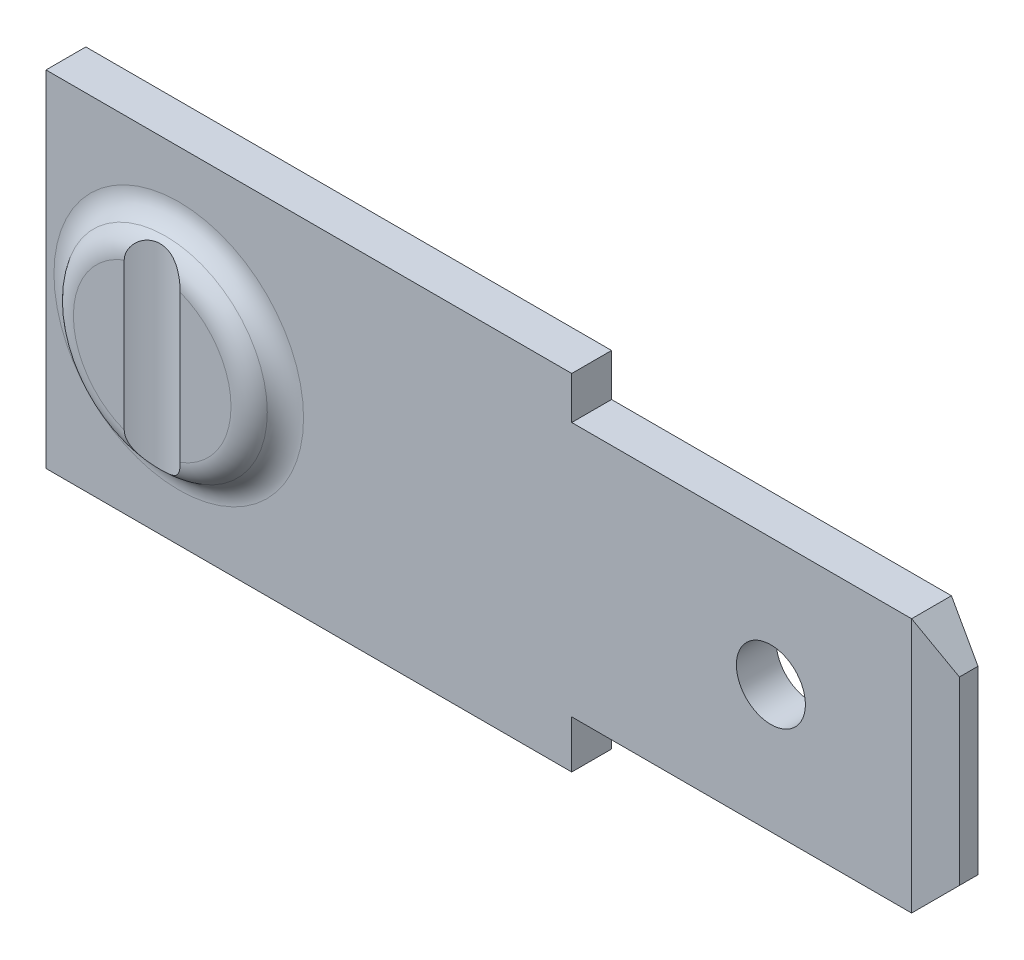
ISO-10303-21;
HEADER;
FILE_DESCRIPTION(('STEP AP214'),'2;1');
FILE_NAME('part.step','',(''),(''),'','','');
FILE_SCHEMA(('AUTOMOTIVE_DESIGN { 1 0 10303 214 1 1 1 1 }'));
ENDSEC;
DATA;
#1=APPLICATION_CONTEXT('core data for automotive mechanical design processes');
#2=APPLICATION_PROTOCOL_DEFINITION('international standard','automotive_design',2000,#1);
#3=PRODUCT_CONTEXT('',#1,'mechanical');
#4=PRODUCT('Part','Part','',(#3));
#5=PRODUCT_RELATED_PRODUCT_CATEGORY('part','',(#4));
#6=PRODUCT_DEFINITION_FORMATION('','',#4);
#7=PRODUCT_DEFINITION_CONTEXT('part definition',#1,'design');
#8=PRODUCT_DEFINITION('design','',#6,#7);
#9=PRODUCT_DEFINITION_SHAPE('','',#8);
#10=(LENGTH_UNIT() NAMED_UNIT(*) SI_UNIT(.MILLI.,.METRE.));
#11=(NAMED_UNIT(*) PLANE_ANGLE_UNIT() SI_UNIT($,.RADIAN.));
#12=(NAMED_UNIT(*) SI_UNIT($,.STERADIAN.) SOLID_ANGLE_UNIT());
#13=UNCERTAINTY_MEASURE_WITH_UNIT(LENGTH_MEASURE(1.E-05),#10,'distance_accuracy_value','');
#14=(GEOMETRIC_REPRESENTATION_CONTEXT(3) GLOBAL_UNCERTAINTY_ASSIGNED_CONTEXT((#13)) GLOBAL_UNIT_ASSIGNED_CONTEXT((#10,
#11,#12)) REPRESENTATION_CONTEXT('',''));
#15=CARTESIAN_POINT('',(0.,0.,0.));
#16=DIRECTION('',(0.,0.,1.));
#17=DIRECTION('',(1.,0.,0.));
#18=AXIS2_PLACEMENT_3D('',#15,#16,#17);
#19=CARTESIAN_POINT('',(2.5,3.25,1.25));
#20=DIRECTION('',(0.,0.,1.));
#21=DIRECTION('',(1.,0.,0.));
#22=AXIS2_PLACEMENT_3D('',#19,#20,#21);
#23=PLANE('',#22);
#24=DIRECTION('',(0.,-1.,0.));
#25=VECTOR('',#24,1.);
#26=CARTESIAN_POINT('',(1.97321731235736,6.5,1.25));
#27=LINE('',#26,#25);
#28=CARTESIAN_POINT('',(1.97321731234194,4.63732858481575,1.2500000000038));
#29=VERTEX_POINT('',#28);
#30=CARTESIAN_POINT('',(1.97321731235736,1.86267141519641,1.25));
#31=VERTEX_POINT('',#30);
#32=EDGE_CURVE('E124',#29,#31,#27,.T.);
#33=ORIENTED_EDGE('',*,*,#32,.F.);
#34=CARTESIAN_POINT('',(2.5,3.25,1.25));
#35=DIRECTION('',(0.,0.,1.));
#36=DIRECTION('',(1.,0.,0.));
#37=AXIS2_PLACEMENT_3D('',#34,#35,#36);
#38=CIRCLE('',#37,1.48397459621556);
#39=EDGE_CURVE('E133',#29,#31,#38,.T.);
#40=ORIENTED_EDGE('',*,*,#39,.T.);
#41=EDGE_LOOP('',(#33,#40));
#42=FACE_BOUND('',#41,.T.);
#43=ADVANCED_FACE('F31',(#42),#23,.T.);
#44=CARTESIAN_POINT('',(0.,6.5,0.75));
#45=DIRECTION('',(0.,0.,-1.));
#46=DIRECTION('',(-1.,0.,0.));
#47=AXIS2_PLACEMENT_3D('',#44,#45,#46);
#48=PLANE('',#47);
#49=CARTESIAN_POINT('',(2.5,3.25,0.75));
#50=DIRECTION('',(0.,0.,-1.));
#51=DIRECTION('',(-1.,0.,0.));
#52=AXIS2_PLACEMENT_3D('',#49,#50,#51);
#53=CIRCLE('',#52,2.35);
#54=CARTESIAN_POINT('',(0.15,3.25,0.75));
#55=VERTEX_POINT('',#54);
#56=EDGE_CURVE('E141',#55,#55,#53,.T.);
#57=ORIENTED_EDGE('',*,*,#56,.T.);
#58=EDGE_LOOP('',(#57));
#59=FACE_BOUND('',#58,.T.);
#60=CARTESIAN_POINT('',(13.65,3.3,0.75));
#61=DIRECTION('',(0.,0.,1.));
#62=DIRECTION('',(1.,0.,0.));
#63=AXIS2_PLACEMENT_3D('',#60,#61,#62);
#64=CIRCLE('',#63,0.649999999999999);
#65=CARTESIAN_POINT('',(14.3,3.3,0.75));
#66=VERTEX_POINT('',#65);
#67=EDGE_CURVE('E404',#66,#66,#64,.T.);
#68=ORIENTED_EDGE('',*,*,#67,.F.);
#69=EDGE_LOOP('',(#68));
#70=FACE_BOUND('',#69,.T.);
#71=DIRECTION('',(1.,0.,0.));
#72=VECTOR('',#71,1.);
#73=CARTESIAN_POINT('',(9.9,0.9,0.75));
#74=LINE('',#73,#72);
#75=CARTESIAN_POINT('',(9.9,0.9,0.75));
#76=VERTEX_POINT('',#75);
#77=CARTESIAN_POINT('',(16.3,0.9,0.75));
#78=VERTEX_POINT('',#77);
#79=EDGE_CURVE('E410',#76,#78,#74,.T.);
#80=ORIENTED_EDGE('',*,*,#79,.T.);
#81=DIRECTION('',(0.,1.,0.));
#82=VECTOR('',#81,1.);
#83=CARTESIAN_POINT('',(16.3,6.5,0.75));
#84=LINE('',#83,#82);
#85=CARTESIAN_POINT('',(16.3,5.7,0.75));
#86=VERTEX_POINT('',#85);
#87=EDGE_CURVE('E355',#78,#86,#84,.T.);
#88=ORIENTED_EDGE('',*,*,#87,.T.);
#89=DIRECTION('',(-1.,0.,0.));
#90=VECTOR('',#89,1.);
#91=CARTESIAN_POINT('',(9.9,5.7,0.75));
#92=LINE('',#91,#90);
#93=CARTESIAN_POINT('',(9.9,5.7,0.75));
#94=VERTEX_POINT('',#93);
#95=EDGE_CURVE('E408',#86,#94,#92,.T.);
#96=ORIENTED_EDGE('',*,*,#95,.T.);
#97=DIRECTION('',(0.,1.,0.));
#98=VECTOR('',#97,1.);
#99=CARTESIAN_POINT('',(9.9,5.7,0.75));
#100=LINE('',#99,#98);
#101=CARTESIAN_POINT('',(9.9,6.5,0.75));
#102=VERTEX_POINT('',#101);
#103=EDGE_CURVE('E406',#94,#102,#100,.T.);
#104=ORIENTED_EDGE('',*,*,#103,.T.);
#105=DIRECTION('',(-1.,0.,0.));
#106=VECTOR('',#105,1.);
#107=CARTESIAN_POINT('',(0.,6.5,0.75));
#108=LINE('',#107,#106);
#109=CARTESIAN_POINT('',(0.,6.5,0.75));
#110=VERTEX_POINT('',#109);
#111=EDGE_CURVE('E386',#102,#110,#108,.T.);
#112=ORIENTED_EDGE('',*,*,#111,.T.);
#113=DIRECTION('',(0.,-1.,0.));
#114=VECTOR('',#113,1.);
#115=CARTESIAN_POINT('',(0.,0.,0.75));
#116=LINE('',#115,#114);
#117=CARTESIAN_POINT('',(0.,0.,0.75));
#118=VERTEX_POINT('',#117);
#119=EDGE_CURVE('E389',#110,#118,#116,.T.);
#120=ORIENTED_EDGE('',*,*,#119,.T.);
#121=DIRECTION('',(1.,0.,0.));
#122=VECTOR('',#121,1.);
#123=CARTESIAN_POINT('',(0.,0.,0.75));
#124=LINE('',#123,#122);
#125=CARTESIAN_POINT('',(9.9,0.,0.75));
#126=VERTEX_POINT('',#125);
#127=EDGE_CURVE('E415',#118,#126,#124,.T.);
#128=ORIENTED_EDGE('',*,*,#127,.T.);
#129=DIRECTION('',(0.,1.,0.));
#130=VECTOR('',#129,1.);
#131=CARTESIAN_POINT('',(9.9,0.,0.75));
#132=LINE('',#131,#130);
#133=EDGE_CURVE('E413',#126,#76,#132,.T.);
#134=ORIENTED_EDGE('',*,*,#133,.T.);
#135=EDGE_LOOP('',(#80,#88,#96,#104,#112,#120,#128,#134));
#136=FACE_BOUND('',#135,.T.);
#137=ADVANCED_FACE('F162',(#59,#70,#136),#48,.F.);
#138=CARTESIAN_POINT('',(0.,6.5,0.));
#139=DIRECTION('',(0.,0.,-1.));
#140=DIRECTION('',(-1.,0.,0.));
#141=AXIS2_PLACEMENT_3D('',#138,#139,#140);
#142=PLANE('',#141);
#143=DIRECTION('',(-1.,0.,0.));
#144=VECTOR('',#143,1.);
#145=CARTESIAN_POINT('',(9.9,5.7,0.));
#146=LINE('',#145,#144);
#147=CARTESIAN_POINT('',(16.3,5.7,0.));
#148=VERTEX_POINT('',#147);
#149=CARTESIAN_POINT('',(9.9,5.7,0.));
#150=VERTEX_POINT('',#149);
#151=EDGE_CURVE('E392',#148,#150,#146,.T.);
#152=ORIENTED_EDGE('',*,*,#151,.F.);
#153=DIRECTION('',(0.,-1.,0.));
#154=VECTOR('',#153,1.);
#155=CARTESIAN_POINT('',(16.3,1.6,0.));
#156=LINE('',#155,#154);
#157=CARTESIAN_POINT('',(16.3,0.9,0.));
#158=VERTEX_POINT('',#157);
#159=EDGE_CURVE('E341',#148,#158,#156,.T.);
#160=ORIENTED_EDGE('',*,*,#159,.T.);
#161=DIRECTION('',(1.,0.,0.));
#162=VECTOR('',#161,1.);
#163=CARTESIAN_POINT('',(9.9,0.9,0.));
#164=LINE('',#163,#162);
#165=CARTESIAN_POINT('',(9.9,0.9,0.));
#166=VERTEX_POINT('',#165);
#167=EDGE_CURVE('E394',#166,#158,#164,.T.);
#168=ORIENTED_EDGE('',*,*,#167,.F.);
#169=DIRECTION('',(0.,1.,0.));
#170=VECTOR('',#169,1.);
#171=CARTESIAN_POINT('',(9.9,0.,0.));
#172=LINE('',#171,#170);
#173=CARTESIAN_POINT('',(9.9,0.,0.));
#174=VERTEX_POINT('',#173);
#175=EDGE_CURVE('E397',#174,#166,#172,.T.);
#176=ORIENTED_EDGE('',*,*,#175,.F.);
#177=DIRECTION('',(1.,0.,0.));
#178=VECTOR('',#177,1.);
#179=CARTESIAN_POINT('',(0.,0.,0.));
#180=LINE('',#179,#178);
#181=CARTESIAN_POINT('',(0.,0.,0.));
#182=VERTEX_POINT('',#181);
#183=EDGE_CURVE('E399',#182,#174,#180,.T.);
#184=ORIENTED_EDGE('',*,*,#183,.F.);
#185=DIRECTION('',(0.,-1.,0.));
#186=VECTOR('',#185,1.);
#187=CARTESIAN_POINT('',(0.,0.,0.));
#188=LINE('',#187,#186);
#189=CARTESIAN_POINT('',(0.,6.5,0.));
#190=VERTEX_POINT('',#189);
#191=EDGE_CURVE('E401',#190,#182,#188,.T.);
#192=ORIENTED_EDGE('',*,*,#191,.F.);
#193=DIRECTION('',(-1.,0.,0.));
#194=VECTOR('',#193,1.);
#195=CARTESIAN_POINT('',(0.,6.5,0.));
#196=LINE('',#195,#194);
#197=CARTESIAN_POINT('',(9.9,6.5,0.));
#198=VERTEX_POINT('',#197);
#199=EDGE_CURVE('E387',#198,#190,#196,.T.);
#200=ORIENTED_EDGE('',*,*,#199,.F.);
#201=DIRECTION('',(0.,1.,0.));
#202=VECTOR('',#201,1.);
#203=CARTESIAN_POINT('',(9.9,5.7,0.));
#204=LINE('',#203,#202);
#205=EDGE_CURVE('E390',#150,#198,#204,.T.);
#206=ORIENTED_EDGE('',*,*,#205,.F.);
#207=EDGE_LOOP('',(#152,#160,#168,#176,#184,#192,#200,#206));
#208=FACE_BOUND('',#207,.T.);
#209=CARTESIAN_POINT('',(13.65,3.3,0.));
#210=DIRECTION('',(0.,0.,1.));
#211=DIRECTION('',(1.,0.,0.));
#212=AXIS2_PLACEMENT_3D('',#209,#210,#211);
#213=CIRCLE('',#212,0.649999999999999);
#214=CARTESIAN_POINT('',(14.3,3.3,0.));
#215=VERTEX_POINT('',#214);
#216=EDGE_CURVE('E134',#215,#215,#213,.T.);
#217=ORIENTED_EDGE('',*,*,#216,.T.);
#218=EDGE_LOOP('',(#217));
#219=FACE_BOUND('',#218,.T.);
#220=ADVANCED_FACE('F165',(#208,#219),#142,.T.);
#221=CARTESIAN_POINT('',(0.,0.,0.75));
#222=DIRECTION('',(1.,0.,0.));
#223=DIRECTION('',(0.,0.,-1.));
#224=AXIS2_PLACEMENT_3D('',#221,#222,#223);
#225=PLANE('',#224);
#226=ORIENTED_EDGE('',*,*,#191,.T.);
#227=DIRECTION('',(0.,0.,-1.));
#228=VECTOR('',#227,1.);
#229=CARTESIAN_POINT('',(0.,0.,0.75));
#230=LINE('',#229,#228);
#231=EDGE_CURVE('E358',#118,#182,#230,.T.);
#232=ORIENTED_EDGE('',*,*,#231,.F.);
#233=ORIENTED_EDGE('',*,*,#119,.F.);
#234=DIRECTION('',(0.,0.,-1.));
#235=VECTOR('',#234,1.);
#236=CARTESIAN_POINT('',(0.,6.5,0.75));
#237=LINE('',#236,#235);
#238=EDGE_CURVE('E383',#110,#190,#237,.T.);
#239=ORIENTED_EDGE('',*,*,#238,.T.);
#240=EDGE_LOOP('',(#226,#232,#233,#239));
#241=FACE_BOUND('',#240,.T.);
#242=ADVANCED_FACE('F169',(#241),#225,.F.);
#243=CARTESIAN_POINT('',(0.,0.,0.75));
#244=DIRECTION('',(0.,1.,0.));
#245=DIRECTION('',(0.,0.,1.));
#246=AXIS2_PLACEMENT_3D('',#243,#244,#245);
#247=PLANE('',#246);
#248=ORIENTED_EDGE('',*,*,#183,.T.);
#249=DIRECTION('',(0.,0.,-1.));
#250=VECTOR('',#249,1.);
#251=CARTESIAN_POINT('',(9.9,0.,0.75));
#252=LINE('',#251,#250);
#253=EDGE_CURVE('E361',#126,#174,#252,.T.);
#254=ORIENTED_EDGE('',*,*,#253,.F.);
#255=ORIENTED_EDGE('',*,*,#127,.F.);
#256=ORIENTED_EDGE('',*,*,#231,.T.);
#257=EDGE_LOOP('',(#248,#254,#255,#256));
#258=FACE_BOUND('',#257,.T.);
#259=ADVANCED_FACE('F200',(#258),#247,.F.);
#260=CARTESIAN_POINT('',(9.9,0.,0.75));
#261=DIRECTION('',(-1.,0.,0.));
#262=DIRECTION('',(0.,0.,1.));
#263=AXIS2_PLACEMENT_3D('',#260,#261,#262);
#264=PLANE('',#263);
#265=ORIENTED_EDGE('',*,*,#175,.T.);
#266=DIRECTION('',(0.,0.,-1.));
#267=VECTOR('',#266,1.);
#268=CARTESIAN_POINT('',(9.9,0.9,0.75));
#269=LINE('',#268,#267);
#270=EDGE_CURVE('E364',#76,#166,#269,.T.);
#271=ORIENTED_EDGE('',*,*,#270,.F.);
#272=ORIENTED_EDGE('',*,*,#133,.F.);
#273=ORIENTED_EDGE('',*,*,#253,.T.);
#274=EDGE_LOOP('',(#265,#271,#272,#273));
#275=FACE_BOUND('',#274,.T.);
#276=ADVANCED_FACE('F196',(#275),#264,.F.);
#277=CARTESIAN_POINT('',(9.9,0.9,0.75));
#278=DIRECTION('',(0.,1.,0.));
#279=DIRECTION('',(-1.,0.,0.));
#280=AXIS2_PLACEMENT_3D('',#277,#278,#279);
#281=PLANE('',#280);
#282=ORIENTED_EDGE('',*,*,#167,.T.);
#283=DIRECTION('',(0.,0.,-1.));
#284=VECTOR('',#283,1.);
#285=CARTESIAN_POINT('',(16.3,0.9,0.75));
#286=LINE('',#285,#284);
#287=EDGE_CURVE('E367',#78,#158,#286,.T.);
#288=ORIENTED_EDGE('',*,*,#287,.F.);
#289=ORIENTED_EDGE('',*,*,#79,.F.);
#290=ORIENTED_EDGE('',*,*,#270,.T.);
#291=EDGE_LOOP('',(#282,#288,#289,#290));
#292=FACE_BOUND('',#291,.T.);
#293=ADVANCED_FACE('F193',(#292),#281,.F.);
#294=CARTESIAN_POINT('',(16.3,0.9,0.75));
#295=DIRECTION('',(-0.707106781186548,0.707106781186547,0.));
#296=DIRECTION('',(-0.707106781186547,-0.707106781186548,0.));
#297=AXIS2_PLACEMENT_3D('',#294,#295,#296);
#298=PLANE('',#297);
#299=ORIENTED_EDGE('',*,*,#287,.T.);
#300=DIRECTION('',(0.693103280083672,0.693103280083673,0.198029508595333));
#301=VECTOR('',#300,1.);
#302=CARTESIAN_POINT('',(18.6333333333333,3.23333333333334,0.666666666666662));
#303=LINE('',#302,#301);
#304=CARTESIAN_POINT('',(17.,1.6,0.2));
#305=VERTEX_POINT('',#304);
#306=EDGE_CURVE('E57',#158,#305,#303,.T.);
#307=ORIENTED_EDGE('',*,*,#306,.T.);
#308=DIRECTION('',(0.,0.,-1.));
#309=VECTOR('',#308,1.);
#310=CARTESIAN_POINT('',(17.,1.6,0.75));
#311=LINE('',#310,#309);
#312=CARTESIAN_POINT('',(17.,1.6,0.549999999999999));
#313=VERTEX_POINT('',#312);
#314=EDGE_CURVE('E369',#313,#305,#311,.T.);
#315=ORIENTED_EDGE('',*,*,#314,.F.);
#316=DIRECTION('',(0.693103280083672,0.693103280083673,-0.198029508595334));
#317=VECTOR('',#316,1.);
#318=CARTESIAN_POINT('',(18.9901960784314,3.59019607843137,-0.0186274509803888));
#319=LINE('',#318,#317);
#320=EDGE_CURVE('E349',#313,#78,#319,.F.);
#321=ORIENTED_EDGE('',*,*,#320,.T.);
#322=EDGE_LOOP('',(#299,#307,#315,#321));
#323=FACE_BOUND('',#322,.T.);
#324=ADVANCED_FACE('F189',(#323),#298,.F.);
#325=CARTESIAN_POINT('',(17.,5.,0.75));
#326=DIRECTION('',(-1.,0.,0.));
#327=DIRECTION('',(0.,0.,1.));
#328=AXIS2_PLACEMENT_3D('',#325,#326,#327);
#329=PLANE('',#328);
#330=ORIENTED_EDGE('',*,*,#314,.T.);
#331=DIRECTION('',(0.,1.,0.));
#332=VECTOR('',#331,1.);
#333=CARTESIAN_POINT('',(17.,5.,0.2));
#334=LINE('',#333,#332);
#335=CARTESIAN_POINT('',(17.,5.,0.2));
#336=VERTEX_POINT('',#335);
#337=EDGE_CURVE('E346',#305,#336,#334,.T.);
#338=ORIENTED_EDGE('',*,*,#337,.T.);
#339=DIRECTION('',(0.,0.,-1.));
#340=VECTOR('',#339,1.);
#341=CARTESIAN_POINT('',(17.,5.,0.75));
#342=LINE('',#341,#340);
#343=CARTESIAN_POINT('',(17.,5.,0.549999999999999));
#344=VERTEX_POINT('',#343);
#345=EDGE_CURVE('E371',#344,#336,#342,.T.);
#346=ORIENTED_EDGE('',*,*,#345,.F.);
#347=DIRECTION('',(0.,-1.,0.));
#348=VECTOR('',#347,1.);
#349=CARTESIAN_POINT('',(17.,5.,0.549999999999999));
#350=LINE('',#349,#348);
#351=EDGE_CURVE('E351',#344,#313,#350,.T.);
#352=ORIENTED_EDGE('',*,*,#351,.T.);
#353=EDGE_LOOP('',(#330,#338,#346,#352));
#354=FACE_BOUND('',#353,.T.);
#355=ADVANCED_FACE('F185',(#354),#329,.F.);
#356=CARTESIAN_POINT('',(16.3,5.7,0.75));
#357=DIRECTION('',(-0.707106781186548,-0.707106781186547,0.));
#358=DIRECTION('',(0.707106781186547,-0.707106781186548,0.));
#359=AXIS2_PLACEMENT_3D('',#356,#357,#358);
#360=PLANE('',#359);
#361=ORIENTED_EDGE('',*,*,#345,.T.);
#362=DIRECTION('',(-0.693103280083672,0.693103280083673,-0.198029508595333));
#363=VECTOR('',#362,1.);
#364=CARTESIAN_POINT('',(17.,5.,0.2));
#365=LINE('',#364,#363);
#366=EDGE_CURVE('E342',#336,#148,#365,.T.);
#367=ORIENTED_EDGE('',*,*,#366,.T.);
#368=DIRECTION('',(0.,0.,-1.));
#369=VECTOR('',#368,1.);
#370=CARTESIAN_POINT('',(16.3,5.7,0.75));
#371=LINE('',#370,#369);
#372=EDGE_CURVE('E374',#86,#148,#371,.T.);
#373=ORIENTED_EDGE('',*,*,#372,.F.);
#374=DIRECTION('',(-0.693103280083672,0.693103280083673,0.198029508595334));
#375=VECTOR('',#374,1.);
#376=CARTESIAN_POINT('',(15.9156862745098,6.0843137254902,0.859803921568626));
#377=LINE('',#376,#375);
#378=EDGE_CURVE('E353',#86,#344,#377,.F.);
#379=ORIENTED_EDGE('',*,*,#378,.T.);
#380=EDGE_LOOP('',(#361,#367,#373,#379));
#381=FACE_BOUND('',#380,.T.);
#382=ADVANCED_FACE('F181',(#381),#360,.F.);
#383=CARTESIAN_POINT('',(9.9,5.7,0.75));
#384=DIRECTION('',(0.,-1.,0.));
#385=DIRECTION('',(1.,0.,0.));
#386=AXIS2_PLACEMENT_3D('',#383,#384,#385);
#387=PLANE('',#386);
#388=ORIENTED_EDGE('',*,*,#151,.T.);
#389=DIRECTION('',(0.,0.,-1.));
#390=VECTOR('',#389,1.);
#391=CARTESIAN_POINT('',(9.9,5.7,0.75));
#392=LINE('',#391,#390);
#393=EDGE_CURVE('E377',#94,#150,#392,.T.);
#394=ORIENTED_EDGE('',*,*,#393,.F.);
#395=ORIENTED_EDGE('',*,*,#95,.F.);
#396=ORIENTED_EDGE('',*,*,#372,.T.);
#397=EDGE_LOOP('',(#388,#394,#395,#396));
#398=FACE_BOUND('',#397,.T.);
#399=ADVANCED_FACE('F177',(#398),#387,.F.);
#400=CARTESIAN_POINT('',(9.9,5.7,0.75));
#401=DIRECTION('',(-1.,0.,0.));
#402=DIRECTION('',(0.,0.,1.));
#403=AXIS2_PLACEMENT_3D('',#400,#401,#402);
#404=PLANE('',#403);
#405=ORIENTED_EDGE('',*,*,#205,.T.);
#406=DIRECTION('',(0.,0.,-1.));
#407=VECTOR('',#406,1.);
#408=CARTESIAN_POINT('',(9.9,6.5,0.75));
#409=LINE('',#408,#407);
#410=EDGE_CURVE('E380',#102,#198,#409,.T.);
#411=ORIENTED_EDGE('',*,*,#410,.F.);
#412=ORIENTED_EDGE('',*,*,#103,.F.);
#413=ORIENTED_EDGE('',*,*,#393,.T.);
#414=EDGE_LOOP('',(#405,#411,#412,#413));
#415=FACE_BOUND('',#414,.T.);
#416=ADVANCED_FACE('F173',(#415),#404,.F.);
#417=CARTESIAN_POINT('',(0.,6.5,0.75));
#418=DIRECTION('',(0.,-1.,0.));
#419=DIRECTION('',(0.,0.,-1.));
#420=AXIS2_PLACEMENT_3D('',#417,#418,#419);
#421=PLANE('',#420);
#422=ORIENTED_EDGE('',*,*,#199,.T.);
#423=ORIENTED_EDGE('',*,*,#238,.F.);
#424=ORIENTED_EDGE('',*,*,#111,.F.);
#425=ORIENTED_EDGE('',*,*,#410,.T.);
#426=EDGE_LOOP('',(#422,#423,#424,#425));
#427=FACE_BOUND('',#426,.T.);
#428=ADVANCED_FACE('F160',(#427),#421,.F.);
#429=CARTESIAN_POINT('',(13.65,3.3,0.75));
#430=DIRECTION('',(0.,0.,-1.));
#431=DIRECTION('',(-1.,0.,0.));
#432=AXIS2_PLACEMENT_3D('',#429,#430,#431);
#433=CYLINDRICAL_SURFACE('',#432,0.649999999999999);
#434=ORIENTED_EDGE('',*,*,#67,.T.);
#435=EDGE_LOOP('',(#434));
#436=FACE_BOUND('',#435,.T.);
#437=ORIENTED_EDGE('',*,*,#216,.F.);
#438=EDGE_LOOP('',(#437));
#439=FACE_BOUND('',#438,.T.);
#440=ADVANCED_FACE('F156',(#436,#439),#433,.F.);
#441=CARTESIAN_POINT('',(16.3,6.5,0.75));
#442=DIRECTION('',(-0.274721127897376,0.,-0.961523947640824));
#443=DIRECTION('',(-0.961523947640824,0.,0.274721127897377));
#444=AXIS2_PLACEMENT_3D('',#441,#442,#443);
#445=PLANE('',#444);
#446=ORIENTED_EDGE('',*,*,#320,.F.);
#447=ORIENTED_EDGE('',*,*,#351,.F.);
#448=ORIENTED_EDGE('',*,*,#378,.F.);
#449=ORIENTED_EDGE('',*,*,#87,.F.);
#450=EDGE_LOOP('',(#446,#447,#448,#449));
#451=FACE_BOUND('',#450,.T.);
#452=ADVANCED_FACE('F159',(#451),#445,.F.);
#453=CARTESIAN_POINT('',(17.,5.,0.2));
#454=DIRECTION('',(0.274721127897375,0.,-0.961523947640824));
#455=DIRECTION('',(-0.961523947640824,0.,-0.274721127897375));
#456=AXIS2_PLACEMENT_3D('',#453,#454,#455);
#457=PLANE('',#456);
#458=ORIENTED_EDGE('',*,*,#306,.F.);
#459=ORIENTED_EDGE('',*,*,#159,.F.);
#460=ORIENTED_EDGE('',*,*,#366,.F.);
#461=ORIENTED_EDGE('',*,*,#337,.F.);
#462=EDGE_LOOP('',(#458,#459,#460,#461));
#463=FACE_BOUND('',#462,.T.);
#464=ADVANCED_FACE('F154',(#463),#457,.T.);
#465=DIRECTION('',(0.,-1.,0.));
#466=VECTOR('',#465,1.);
#467=CARTESIAN_POINT('',(3.02678268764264,6.5,1.25));
#468=LINE('',#467,#466);
#469=CARTESIAN_POINT('',(3.02678268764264,1.86267141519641,1.25));
#470=VERTEX_POINT('',#469);
#471=CARTESIAN_POINT('',(3.02678268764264,4.63732858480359,1.25));
#472=VERTEX_POINT('',#471);
#473=EDGE_CURVE('E49',#470,#472,#468,.F.);
#474=ORIENTED_EDGE('',*,*,#473,.F.);
#475=EDGE_CURVE('E137',#470,#472,#38,.T.);
#476=ORIENTED_EDGE('',*,*,#475,.T.);
#477=EDGE_LOOP('',(#474,#476));
#478=FACE_BOUND('',#477,.T.);
#479=ADVANCED_FACE('F149',(#478),#23,.T.);
#480=CARTESIAN_POINT('',(2.5,3.25,1.25));
#481=DIRECTION('',(0.,0.,-1.));
#482=DIRECTION('',(-1.,0.,0.));
#483=AXIS2_PLACEMENT_3D('',#480,#481,#482);
#484=TOROIDAL_SURFACE('',#483,2.35,0.5);
#485=CARTESIAN_POINT('',(2.5,3.25,0.999999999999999));
#486=DIRECTION('',(0.,0.,1.));
#487=DIRECTION('',(1.,0.,0.));
#488=AXIS2_PLACEMENT_3D('',#485,#486,#487);
#489=CIRCLE('',#488,1.91698729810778);
#490=CARTESIAN_POINT('',(4.41698729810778,3.25,0.999999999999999));
#491=VERTEX_POINT('',#490);
#492=EDGE_CURVE('E130',#491,#491,#489,.F.);
#493=ORIENTED_EDGE('',*,*,#492,.T.);
#494=EDGE_LOOP('',(#493));
#495=FACE_BOUND('',#494,.T.);
#496=ORIENTED_EDGE('',*,*,#56,.F.);
#497=EDGE_LOOP('',(#496));
#498=FACE_BOUND('',#497,.T.);
#499=ADVANCED_FACE('F153',(#495,#498),#484,.F.);
#500=CARTESIAN_POINT('',(2.5,3.25,0.75));
#501=DIRECTION('',(0.,0.,-1.));
#502=DIRECTION('',(-1.,0.,0.));
#503=AXIS2_PLACEMENT_3D('',#500,#501,#502);
#504=TOROIDAL_SURFACE('',#503,1.48397459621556,0.5);
#505=CARTESIAN_POINT('',(2.02691884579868,1.66161062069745,1.21898114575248));
#506=CARTESIAN_POINT('',(2.04000373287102,1.63788379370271,1.21195522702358));
#507=CARTESIAN_POINT('',(2.05517976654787,1.61549140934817,1.20418296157));
#508=CARTESIAN_POINT('',(2.08918103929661,1.57384303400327,1.18808874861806));
#509=CARTESIAN_POINT('',(2.10801665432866,1.55459625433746,1.1797652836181));
#510=CARTESIAN_POINT('',(2.14870124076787,1.51963520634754,1.16348170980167));
#511=CARTESIAN_POINT('',(2.17053710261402,1.50390631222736,1.15552021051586));
#512=CARTESIAN_POINT('',(2.2166855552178,1.47603237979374,1.14066679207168));
#513=CARTESIAN_POINT('',(2.24099655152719,1.4638850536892,1.13377419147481));
#514=CARTESIAN_POINT('',(2.29284510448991,1.44264698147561,1.12130980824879));
#515=CARTESIAN_POINT('',(2.32048568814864,1.43375446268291,1.11582838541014));
#516=CARTESIAN_POINT('',(2.37709931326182,1.41996337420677,1.10716752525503));
#517=CARTESIAN_POINT('',(2.4060729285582,1.41506654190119,1.10398908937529));
#518=CARTESIAN_POINT('',(2.46562946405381,1.4091404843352,1.10012995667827));
#519=CARTESIAN_POINT('',(2.49623290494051,1.40825561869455,1.09954250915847));
#520=CARTESIAN_POINT('',(2.55719311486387,1.41074031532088,1.10117120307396));
#521=CARTESIAN_POINT('',(2.58754986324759,1.41411023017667,1.10338757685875));
#522=CARTESIAN_POINT('',(2.64747236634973,1.42518552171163,1.11046926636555));
#523=CARTESIAN_POINT('',(2.6770268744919,1.43293483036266,1.11536140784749));
#524=CARTESIAN_POINT('',(2.73414034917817,1.45282750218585,1.12735948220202));
#525=CARTESIAN_POINT('',(2.76169966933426,1.46497008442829,1.13446502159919));
#526=CARTESIAN_POINT('',(2.81355293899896,1.49338383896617,1.15004949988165));
#527=CARTESIAN_POINT('',(2.83789299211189,1.50958410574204,1.15850402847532));
#528=CARTESIAN_POINT('',(2.88309133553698,1.54607243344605,1.17597148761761));
#529=CARTESIAN_POINT('',(2.90394845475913,1.56636186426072,1.18498460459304));
#530=CARTESIAN_POINT('',(2.94063207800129,1.60969080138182,1.20209386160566));
#531=CARTESIAN_POINT('',(2.9566435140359,1.63256431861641,1.21021304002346));
#532=CARTESIAN_POINT('',(2.98426789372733,1.68126905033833,1.22493973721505));
#533=CARTESIAN_POINT('',(2.995888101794,1.70709528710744,1.23154974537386));
#534=CARTESIAN_POINT('',(3.01102217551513,1.75202395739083,1.24040392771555));
#535=CARTESIAN_POINT('',(3.01594636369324,1.77051616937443,1.24336898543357));
#536=CARTESIAN_POINT('',(3.02321874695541,1.8081808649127,1.24779050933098));
#537=CARTESIAN_POINT('',(3.02557070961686,1.82735231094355,1.24924918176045));
#538=CARTESIAN_POINT('',(3.02708026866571,1.86141329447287,1.25018437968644));
#539=CARTESIAN_POINT('',(3.02685226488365,1.87626457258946,1.25004218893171));
#540=CARTESIAN_POINT('',(3.024377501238,1.90573857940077,1.24851254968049));
#541=CARTESIAN_POINT('',(3.02213331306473,1.9203615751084,1.24712668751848));
#542=CARTESIAN_POINT('',(3.01595331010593,1.94643164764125,1.24337725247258));
#543=CARTESIAN_POINT('',(3.01237470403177,1.95799248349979,1.24122276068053));
#544=CARTESIAN_POINT('',(3.0035625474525,1.9802505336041,1.23602609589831));
#545=CARTESIAN_POINT('',(2.99833065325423,1.99094859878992,1.23298481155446));
#546=CARTESIAN_POINT('',(2.98621251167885,2.01113866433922,1.22613186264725));
#547=CARTESIAN_POINT('',(2.97932141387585,2.02062700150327,1.22231794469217));
#548=CARTESIAN_POINT('',(2.96408015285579,2.03807952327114,1.21416469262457));
#549=CARTESIAN_POINT('',(2.9557294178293,2.04604310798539,1.20982515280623));
#550=CARTESIAN_POINT('',(2.93589676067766,2.06195342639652,1.19992145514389));
#551=CARTESIAN_POINT('',(2.92413085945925,2.06950651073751,1.19429879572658));
#552=CARTESIAN_POINT('',(2.89944425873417,2.08247772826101,1.18314145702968));
#553=CARTESIAN_POINT('',(2.88652115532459,2.08789128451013,1.17760699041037));
#554=CARTESIAN_POINT('',(2.85000547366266,2.10046933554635,1.16292001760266));
#555=CARTESIAN_POINT('',(2.82567633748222,2.10590461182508,1.15416513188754));
#556=CARTESIAN_POINT('',(2.77596654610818,2.11387465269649,1.13847388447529));
#557=CARTESIAN_POINT('',(2.75058169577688,2.11639641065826,1.13154578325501));
#558=CARTESIAN_POINT('',(2.6991820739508,2.119946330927,1.11968215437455));
#559=CARTESIAN_POINT('',(2.67316573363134,2.12097027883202,1.11475227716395));
#560=CARTESIAN_POINT('',(2.62079355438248,2.12232977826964,1.1069686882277));
#561=CARTESIAN_POINT('',(2.59443746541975,2.12266478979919,1.10411660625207));
#562=CARTESIAN_POINT('',(2.54158685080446,2.12306009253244,1.10051440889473));
#563=CARTESIAN_POINT('',(2.5150923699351,2.12312046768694,1.0997636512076));
#564=CARTESIAN_POINT('',(2.46214658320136,2.12306113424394,1.10036586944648));
#565=CARTESIAN_POINT('',(2.4356952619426,2.12294152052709,1.10171773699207));
#566=CARTESIAN_POINT('',(2.37396007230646,2.12226496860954,1.10734039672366));
#567=CARTESIAN_POINT('',(2.3387461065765,2.12157257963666,1.11245064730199));
#568=CARTESIAN_POINT('',(2.28659986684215,2.11900582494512,1.12287424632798));
#569=CARTESIAN_POINT('',(2.26934454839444,2.11789712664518,1.12680399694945));
#570=CARTESIAN_POINT('',(2.23514080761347,2.11482782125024,1.13555175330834));
#571=CARTESIAN_POINT('',(2.21819218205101,2.11286780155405,1.14036914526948));
#572=CARTESIAN_POINT('',(2.18525904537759,2.10771699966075,1.15067044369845));
#573=CARTESIAN_POINT('',(2.1692609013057,2.10456569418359,1.15612945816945));
#574=CARTESIAN_POINT('',(2.13795441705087,2.09645120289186,1.16769107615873));
#575=CARTESIAN_POINT('',(2.12264549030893,2.09148959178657,1.17379311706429));
#576=CARTESIAN_POINT('',(2.09600271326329,2.08025211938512,1.18514782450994));
#577=CARTESIAN_POINT('',(2.08446689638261,2.0744061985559,1.19034107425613));
#578=CARTESIAN_POINT('',(2.06257839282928,2.06076253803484,1.20066244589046));
#579=CARTESIAN_POINT('',(2.05222350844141,2.05296851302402,1.20579067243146));
#580=CARTESIAN_POINT('',(2.03457587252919,2.0366529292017,1.21486480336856));
#581=CARTESIAN_POINT('',(2.02705674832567,2.0284122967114,1.21887307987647));
#582=CARTESIAN_POINT('',(2.01344627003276,2.0105966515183,1.22631480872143));
#583=CARTESIAN_POINT('',(2.00735479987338,2.00102174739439,1.22974830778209));
#584=CARTESIAN_POINT('',(1.99672646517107,1.98085457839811,1.23585096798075));
#585=CARTESIAN_POINT('',(1.99218656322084,1.97026435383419,1.23852162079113));
#586=CARTESIAN_POINT('',(1.9846195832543,1.94838979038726,1.24302723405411));
#587=CARTESIAN_POINT('',(1.98159374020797,1.93710489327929,1.24486151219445));
#588=CARTESIAN_POINT('',(1.9762034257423,1.91043912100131,1.24814863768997));
#589=CARTESIAN_POINT('',(1.97436838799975,1.89491274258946,1.24928683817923));
#590=CARTESIAN_POINT('',(1.97286106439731,1.86371190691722,1.25022082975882));
#591=CARTESIAN_POINT('',(1.97319324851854,1.84803721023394,1.25001384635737));
#592=CARTESIAN_POINT('',(1.97615156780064,1.81198501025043,1.24818587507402));
#593=CARTESIAN_POINT('',(1.97946957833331,1.79168702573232,1.24613863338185));
#594=CARTESIAN_POINT('',(1.9889049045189,1.75201777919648,1.24045867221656));
#595=CARTESIAN_POINT('',(1.99502112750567,1.73264615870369,1.23682657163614));
#596=CARTESIAN_POINT('',(2.00590705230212,1.70488164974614,1.23058141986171));
#597=CARTESIAN_POINT('',(2.00973203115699,1.69600163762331,1.22841568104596));
#598=CARTESIAN_POINT('',(2.01792395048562,1.67856242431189,1.22385805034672));
#599=CARTESIAN_POINT('',(2.02229058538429,1.67000304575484,1.22146628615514));
#600=CARTESIAN_POINT('',(2.02691884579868,1.66161062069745,1.21898114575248));
#601=B_SPLINE_CURVE_WITH_KNOTS('',3,(#505,#506,#507,#508,#509,#510,#511,#512,#513,#514,#515,
#516,#517,#518,#519,#520,#521,#522,#523,#524,#525,#526,#527,#528,#529,#530,#531,#532,#533,#534,
#535,#536,#537,#538,#539,#540,#541,#542,#543,#544,#545,#546,#547,#548,#549,#550,#551,#552,#553,
#554,#555,#556,#557,#558,#559,#560,#561,#562,#563,#564,#565,#566,#567,#568,#569,#570,#571,#572,
#573,#574,#575,#576,#577,#578,#579,#580,#581,#582,#583,#584,#585,#586,#587,#588,#589,#590,#591,
#592,#593,#594,#595,#596,#597,#598,#599,#600),.UNSPECIFIED.,.T.,.F.,(4,2,2,2,2,2,2,2,2,2,2,2,2,
2,2,2,2,2,2,2,2,2,2,2,2,2,2,2,2,2,2,2,2,2,2,2,2,2,2,2,2,2,2,2,2,2,2,4),(0.,0.0839356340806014,
0.168112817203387,0.251933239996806,0.335700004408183,0.423946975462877,0.512232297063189,
0.603670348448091,0.695115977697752,0.787495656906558,0.879858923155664,0.970708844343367,
1.06158925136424,1.14835723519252,1.23498104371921,1.29288024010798,1.35069451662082,
1.39509866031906,1.43944624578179,1.47616862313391,1.51285432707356,1.54964860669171,
1.58645733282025,1.63141093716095,1.67646019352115,1.75527726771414,1.83444485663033,
1.91383477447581,1.99328689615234,2.07271472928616,2.15210070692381,2.25860906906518,
2.31177339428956,2.36490109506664,2.41640387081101,2.46786195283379,2.50952501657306,
2.55110923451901,2.58650437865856,2.62189664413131,2.65721922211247,2.69257056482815,
2.73934211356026,2.78621016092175,2.84789205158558,2.90954987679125,2.93925546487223,
2.96894437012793),.UNSPECIFIED.);
#602=EDGE_CURVE('E11',#31,#470,#601,.T.);
#603=ORIENTED_EDGE('',*,*,#602,.F.);
#604=ORIENTED_EDGE('',*,*,#39,.F.);
#605=CARTESIAN_POINT('',(1.98850924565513,4.54036660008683,1.24071121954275));
#606=CARTESIAN_POINT('',(1.99233379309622,4.52935823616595,1.23843451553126));
#607=CARTESIAN_POINT('',(1.99693051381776,4.51869317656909,1.23573162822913));
#608=CARTESIAN_POINT('',(2.0076852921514,4.4984195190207,1.2295608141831));
#609=CARTESIAN_POINT('',(2.01384370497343,4.48881116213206,1.22609271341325));
#610=CARTESIAN_POINT('',(2.02759745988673,4.47095695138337,1.21858254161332));
#611=CARTESIAN_POINT('',(2.0351916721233,4.4627100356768,1.2145409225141));
#612=CARTESIAN_POINT('',(2.05157053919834,4.447708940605,1.2061342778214));
#613=CARTESIAN_POINT('',(2.06035567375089,4.44095536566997,1.20176912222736));
#614=CARTESIAN_POINT('',(2.08270715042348,4.42635756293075,1.19111267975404));
#615=CARTESIAN_POINT('',(2.09673101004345,4.41924816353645,1.18478302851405));
#616=CARTESIAN_POINT('',(2.12588887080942,4.40738749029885,1.17247983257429));
#617=CARTESIAN_POINT('',(2.14102614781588,4.40264352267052,1.16650744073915));
#618=CARTESIAN_POINT('',(2.17142279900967,4.3950016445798,1.15538877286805));
#619=CARTESIAN_POINT('',(2.18666093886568,4.39204700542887,1.15022146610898));
#620=CARTESIAN_POINT('',(2.21753402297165,4.38725253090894,1.14058594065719));
#621=CARTESIAN_POINT('',(2.23316935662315,4.38541383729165,1.13611844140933));
#622=CARTESIAN_POINT('',(2.28056305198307,4.38098383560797,1.12382733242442));
#623=CARTESIAN_POINT('',(2.31272223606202,4.37949534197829,1.11714706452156));
#624=CARTESIAN_POINT('',(2.37256825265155,4.37777984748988,1.10776249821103));
#625=CARTESIAN_POINT('',(2.40018540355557,4.37739451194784,1.10460584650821));
#626=CARTESIAN_POINT('',(2.45561107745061,4.37694422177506,1.10059959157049));
#627=CARTESIAN_POINT('',(2.48341970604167,4.37687946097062,1.09975138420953));
#628=CARTESIAN_POINT('',(2.53892734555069,4.37693850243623,1.10037346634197));
#629=CARTESIAN_POINT('',(2.56662643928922,4.37706175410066,1.1018369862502));
#630=CARTESIAN_POINT('',(2.62178831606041,4.37771470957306,1.10705782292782));
#631=CARTESIAN_POINT('',(2.64925124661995,4.37824413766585,1.11081358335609));
#632=CARTESIAN_POINT('',(2.69901761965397,4.38015413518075,1.11973683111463));
#633=CARTESIAN_POINT('',(2.72139108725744,4.3813714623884,1.12454729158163));
#634=CARTESIAN_POINT('',(2.7657241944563,4.38516680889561,1.13567986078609));
#635=CARTESIAN_POINT('',(2.78768256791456,4.38774845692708,1.14200597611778));
#636=CARTESIAN_POINT('',(2.8311532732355,4.39535732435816,1.15614167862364));
#637=CARTESIAN_POINT('',(2.85265119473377,4.40042631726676,1.16397516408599));
#638=CARTESIAN_POINT('',(2.8938517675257,4.41464933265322,1.18056438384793));
#639=CARTESIAN_POINT('',(2.91356710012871,4.42377122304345,1.18931245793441));
#640=CARTESIAN_POINT('',(2.94095447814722,4.4418989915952,1.20240772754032));
#641=CARTESIAN_POINT('',(2.94989331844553,4.44889483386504,1.20686834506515));
#642=CARTESIAN_POINT('',(2.9665032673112,4.46444884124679,1.2154316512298));
#643=CARTESIAN_POINT('',(2.9741749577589,4.4730062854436,1.21953450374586));
#644=CARTESIAN_POINT('',(2.98800926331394,4.4915439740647,1.22712538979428));
#645=CARTESIAN_POINT('',(2.99416780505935,4.50152794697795,1.23061175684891));
#646=CARTESIAN_POINT('',(3.00484035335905,4.52257150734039,1.23676517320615));
#647=CARTESIAN_POINT('',(3.00935324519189,4.53363181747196,1.23943166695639));
#648=CARTESIAN_POINT('',(3.01667816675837,4.55616698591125,1.24380989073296));
#649=CARTESIAN_POINT('',(3.01952836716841,4.56762555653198,1.24554297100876));
#650=CARTESIAN_POINT('',(3.0238109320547,4.59089269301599,1.24816188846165));
#651=CARTESIAN_POINT('',(3.02524271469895,4.60270140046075,1.24904737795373));
#652=CARTESIAN_POINT('',(3.02721664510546,4.63230489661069,1.25026743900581));
#653=CARTESIAN_POINT('',(3.02696942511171,4.65017387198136,1.25011346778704));
#654=CARTESIAN_POINT('',(3.02402738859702,4.68563601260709,1.24829736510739));
#655=CARTESIAN_POINT('',(3.0213270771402,4.70322846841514,1.24663184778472));
#656=CARTESIAN_POINT('',(3.01267861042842,4.742846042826,1.24140025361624));
#657=CARTESIAN_POINT('',(3.00601059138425,4.7646594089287,1.23742025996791));
#658=CARTESIAN_POINT('',(2.98956907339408,4.80671832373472,1.22798436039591));
#659=CARTESIAN_POINT('',(2.97979419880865,4.82696317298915,1.22252780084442));
#660=CARTESIAN_POINT('',(2.95731019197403,4.86584795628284,1.21060056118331));
#661=CARTESIAN_POINT('',(2.94455939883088,4.88445939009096,1.20411594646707));
#662=CARTESIAN_POINT('',(2.91651964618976,4.9194788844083,1.1907406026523));
#663=CARTESIAN_POINT('',(2.90123077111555,4.93588701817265,1.18384988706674));
#664=CARTESIAN_POINT('',(2.8657629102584,4.96879665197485,1.16906360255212));
#665=CARTESIAN_POINT('',(2.8451929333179,4.9848860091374,1.1611853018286));
#666=CARTESIAN_POINT('',(2.80154832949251,5.01371685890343,1.14626991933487));
#667=CARTESIAN_POINT('',(2.77847223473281,5.0264563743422,1.13923333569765));
#668=CARTESIAN_POINT('',(2.72855831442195,5.04935613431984,1.1261030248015));
#669=CARTESIAN_POINT('',(2.70156799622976,5.05924867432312,1.12012074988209));
#670=CARTESIAN_POINT('',(2.6460769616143,5.07508170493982,1.11032524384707));
#671=CARTESIAN_POINT('',(2.61757589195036,5.08102126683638,1.10651252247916));
#672=CARTESIAN_POINT('',(2.55868055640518,5.08912977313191,1.10126888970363));
#673=CARTESIAN_POINT('',(2.52825582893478,5.09114233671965,1.09993685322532));
#674=CARTESIAN_POINT('',(2.46742371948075,5.0909425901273,1.10006781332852));
#675=CARTESIAN_POINT('',(2.43701634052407,5.08872968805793,1.10153120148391));
#676=CARTESIAN_POINT('',(2.37665159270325,5.08000192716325,1.10716758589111));
#677=CARTESIAN_POINT('',(2.34670601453,5.07342881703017,1.11137725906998));
#678=CARTESIAN_POINT('',(2.28857732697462,5.05589180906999,1.12215846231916));
#679=CARTESIAN_POINT('',(2.26039397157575,5.0449285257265,1.12872966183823));
#680=CARTESIAN_POINT('',(2.20698555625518,5.01878760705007,1.14349557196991));
#681=CARTESIAN_POINT('',(2.1817273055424,5.00366559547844,1.15166847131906));
#682=CARTESIAN_POINT('',(2.13452558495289,4.96925042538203,1.16883960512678));
#683=CARTESIAN_POINT('',(2.11258290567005,4.94995627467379,1.17783803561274));
#684=CARTESIAN_POINT('',(2.07354100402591,4.90834225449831,1.19525025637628));
#685=CARTESIAN_POINT('',(2.05628147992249,4.88617677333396,1.20367295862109));
#686=CARTESIAN_POINT('',(2.02607334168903,4.83868780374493,1.21927123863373));
#687=CARTESIAN_POINT('',(2.0131186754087,4.81336881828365,1.22644856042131));
#688=CARTESIAN_POINT('',(1.99537516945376,4.7683529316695,1.23662050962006));
#689=CARTESIAN_POINT('',(1.98930093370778,4.74929390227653,1.24022324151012));
#690=CARTESIAN_POINT('',(1.97986092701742,4.71028293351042,1.24590023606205));
#691=CARTESIAN_POINT('',(1.97649231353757,4.69033195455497,1.2479761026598));
#692=CARTESIAN_POINT('',(1.97334801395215,4.65503116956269,1.24991778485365));
#693=CARTESIAN_POINT('',(1.97288940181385,4.63976476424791,1.25020344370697));
#694=CARTESIAN_POINT('',(1.97401130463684,4.6093516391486,1.249507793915));
#695=CARTESIAN_POINT('',(1.97558548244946,4.59420469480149,1.24853042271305));
#696=CARTESIAN_POINT('',(1.97953357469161,4.57270752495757,1.24611687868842));
#697=CARTESIAN_POINT('',(1.98098623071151,4.56611729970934,1.24523186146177));
#698=CARTESIAN_POINT('',(1.98437752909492,4.55310256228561,1.24318178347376));
#699=CARTESIAN_POINT('',(1.98631647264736,4.54667815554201,1.24201654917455));
#700=CARTESIAN_POINT('',(1.98850924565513,4.54036660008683,1.24071121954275));
#701=B_SPLINE_CURVE_WITH_KNOTS('',3,(#605,#606,#607,#608,#609,#610,#611,#612,#613,#614,#615,
#616,#617,#618,#619,#620,#621,#622,#623,#624,#625,#626,#627,#628,#629,#630,#631,#632,#633,#634,
#635,#636,#637,#638,#639,#640,#641,#642,#643,#644,#645,#646,#647,#648,#649,#650,#651,#652,#653,
#654,#655,#656,#657,#658,#659,#660,#661,#662,#663,#664,#665,#666,#667,#668,#669,#670,#671,#672,
#673,#674,#675,#676,#677,#678,#679,#680,#681,#682,#683,#684,#685,#686,#687,#688,#689,#690,#691,
#692,#693,#694,#695,#696,#697,#698,#699,#700),.UNSPECIFIED.,.T.,.F.,(4,2,2,2,2,2,2,2,2,2,2,2,2,
2,2,2,2,2,2,2,2,2,2,2,2,2,2,2,2,2,2,2,2,2,2,2,2,2,2,2,2,2,2,2,2,2,2,4),(0.,0.0355983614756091,
0.0712048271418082,0.106783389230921,0.142376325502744,0.19293049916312,0.243639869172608,
0.292643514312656,0.341697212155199,0.440084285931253,0.523397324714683,0.606760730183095,
0.689880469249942,0.772943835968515,0.841625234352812,0.910490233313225,0.980553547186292,
1.05007103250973,1.0865107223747,1.12293363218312,1.15945354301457,1.19599814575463,
1.23166692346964,1.26735032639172,1.32066878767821,1.3741069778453,1.44320463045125,
1.51233292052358,1.58249411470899,1.65265297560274,1.73413252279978,1.8156600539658,
1.90334927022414,1.99105908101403,2.08219563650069,2.17334495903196,2.26573722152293,
2.35811655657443,2.44931582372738,2.54053680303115,2.62805936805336,2.71545836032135,
2.77622462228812,2.83692695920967,2.8826046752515,2.92814033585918,2.94853770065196,
2.96894773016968),.UNSPECIFIED.);
#702=EDGE_CURVE('E43',#472,#29,#701,.T.);
#703=ORIENTED_EDGE('',*,*,#702,.F.);
#704=ORIENTED_EDGE('',*,*,#475,.F.);
#705=EDGE_LOOP('',(#603,#604,#703,#704));
#706=FACE_BOUND('',#705,.T.);
#707=ORIENTED_EDGE('',*,*,#492,.F.);
#708=EDGE_LOOP('',(#707));
#709=FACE_BOUND('',#708,.T.);
#710=ADVANCED_FACE('F33',(#706,#709),#504,.T.);
#711=CARTESIAN_POINT('',(2.5,6.5,2.1));
#712=DIRECTION('',(0.,-1.,0.));
#713=DIRECTION('',(0.,0.,-1.));
#714=AXIS2_PLACEMENT_3D('',#711,#712,#713);
#715=CYLINDRICAL_SURFACE('',#714,1.);
#716=ORIENTED_EDGE('',*,*,#602,.T.);
#717=ORIENTED_EDGE('',*,*,#473,.T.);
#718=ORIENTED_EDGE('',*,*,#702,.T.);
#719=ORIENTED_EDGE('',*,*,#32,.T.);
#720=EDGE_LOOP('',(#716,#717,#718,#719));
#721=FACE_BOUND('',#720,.T.);
#722=ADVANCED_FACE('F123',(#721),#715,.F.);
#723=CLOSED_SHELL('',(#43,#137,#220,#242,#259,#276,#293,#324,#355,#382,#399,#416,#428,#440,#452,
#464,#479,#499,#710,#722));
#724=MANIFOLD_SOLID_BREP('B2',#723);
#725=ADVANCED_BREP_SHAPE_REPRESENTATION('',(#18,#724),#14);
#726=SHAPE_DEFINITION_REPRESENTATION(#9,#725);
ENDSEC;
END-ISO-10303-21;
